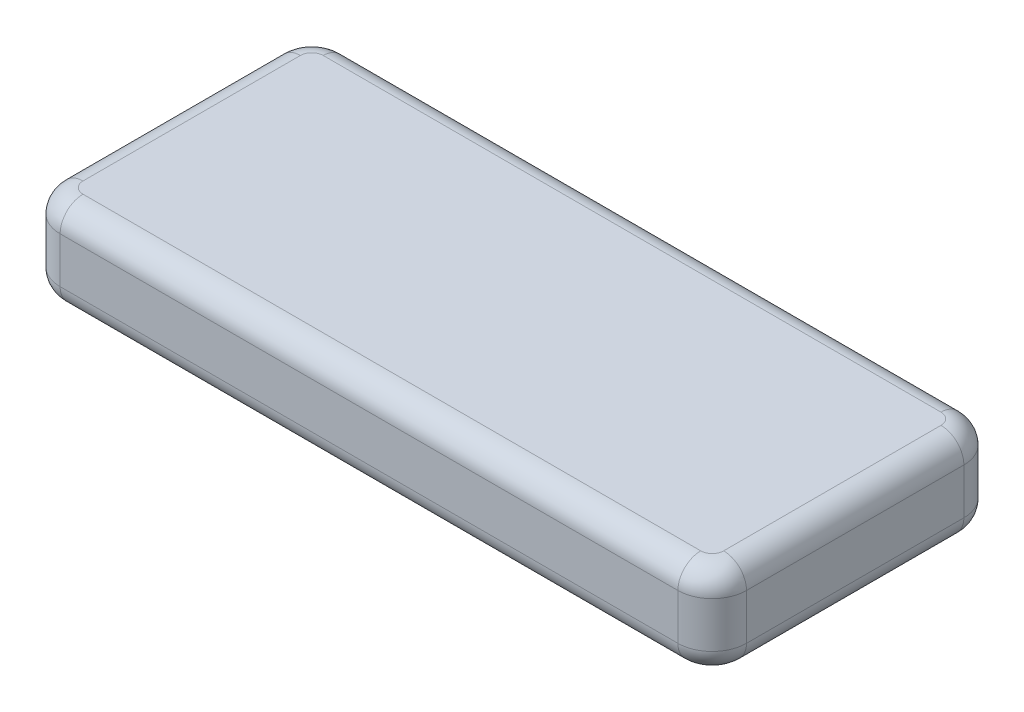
ISO-10303-21;
HEADER;
FILE_DESCRIPTION(('STEP AP214'),'2;1');
FILE_NAME('part.step','',(''),(''),'','','');
FILE_SCHEMA(('AUTOMOTIVE_DESIGN { 1 0 10303 214 1 1 1 1 }'));
ENDSEC;
DATA;
#1=APPLICATION_CONTEXT('core data for automotive mechanical design processes');
#2=APPLICATION_PROTOCOL_DEFINITION('international standard','automotive_design',2000,#1);
#3=PRODUCT_CONTEXT('',#1,'mechanical');
#4=PRODUCT('Part','Part','',(#3));
#5=PRODUCT_RELATED_PRODUCT_CATEGORY('part','',(#4));
#6=PRODUCT_DEFINITION_FORMATION('','',#4);
#7=PRODUCT_DEFINITION_CONTEXT('part definition',#1,'design');
#8=PRODUCT_DEFINITION('design','',#6,#7);
#9=PRODUCT_DEFINITION_SHAPE('','',#8);
#10=(LENGTH_UNIT() NAMED_UNIT(*) SI_UNIT(.MILLI.,.METRE.));
#11=(NAMED_UNIT(*) PLANE_ANGLE_UNIT() SI_UNIT($,.RADIAN.));
#12=(NAMED_UNIT(*) SI_UNIT($,.STERADIAN.) SOLID_ANGLE_UNIT());
#13=UNCERTAINTY_MEASURE_WITH_UNIT(LENGTH_MEASURE(1.E-05),#10,'distance_accuracy_value','');
#14=(GEOMETRIC_REPRESENTATION_CONTEXT(3) GLOBAL_UNCERTAINTY_ASSIGNED_CONTEXT((#13)) GLOBAL_UNIT_ASSIGNED_CONTEXT((#10,
#11,#12)) REPRESENTATION_CONTEXT('',''));
#15=CARTESIAN_POINT('',(0.,0.,0.));
#16=DIRECTION('',(0.,0.,1.));
#17=DIRECTION('',(1.,0.,0.));
#18=AXIS2_PLACEMENT_3D('',#15,#16,#17);
#19=CARTESIAN_POINT('',(27.,4.,9.5));
#20=DIRECTION('',(0.,-1.,0.));
#21=DIRECTION('',(0.,0.,-1.));
#22=AXIS2_PLACEMENT_3D('',#19,#20,#21);
#23=CYLINDRICAL_SURFACE('',#22,3.);
#24=DIRECTION('',(0.,-1.,0.));
#25=VECTOR('',#24,1.);
#26=CARTESIAN_POINT('',(30.,4.,9.49999999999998));
#27=LINE('',#26,#25);
#28=CARTESIAN_POINT('',(30.,2.,9.49999999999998));
#29=VERTEX_POINT('',#28);
#30=CARTESIAN_POINT('',(30.,-2.,9.49999999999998));
#31=VERTEX_POINT('',#30);
#32=EDGE_CURVE('E185',#29,#31,#27,.T.);
#33=ORIENTED_EDGE('',*,*,#32,.F.);
#34=CARTESIAN_POINT('',(27.,2.,9.5));
#35=DIRECTION('',(0.,1.,0.));
#36=DIRECTION('',(0.,0.,1.));
#37=AXIS2_PLACEMENT_3D('',#34,#35,#36);
#38=CIRCLE('',#37,3.);
#39=CARTESIAN_POINT('',(27.,2.,12.5));
#40=VERTEX_POINT('',#39);
#41=EDGE_CURVE('E237',#29,#40,#38,.F.);
#42=ORIENTED_EDGE('',*,*,#41,.T.);
#43=DIRECTION('',(0.,-1.,0.));
#44=VECTOR('',#43,1.);
#45=CARTESIAN_POINT('',(27.,4.,12.5));
#46=LINE('',#45,#44);
#47=CARTESIAN_POINT('',(27.,-2.,12.5));
#48=VERTEX_POINT('',#47);
#49=EDGE_CURVE('E288',#40,#48,#46,.T.);
#50=ORIENTED_EDGE('',*,*,#49,.T.);
#51=CARTESIAN_POINT('',(27.,-2.,9.5));
#52=DIRECTION('',(0.,1.,0.));
#53=DIRECTION('',(0.,0.,1.));
#54=AXIS2_PLACEMENT_3D('',#51,#52,#53);
#55=CIRCLE('',#54,3.);
#56=EDGE_CURVE('E234',#48,#31,#55,.T.);
#57=ORIENTED_EDGE('',*,*,#56,.T.);
#58=EDGE_LOOP('',(#33,#42,#50,#57));
#59=FACE_BOUND('',#58,.T.);
#60=ADVANCED_FACE('F48',(#59),#23,.T.);
#61=CARTESIAN_POINT('',(30.,4.,9.49999999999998));
#62=DIRECTION('',(-1.,0.,0.));
#63=DIRECTION('',(0.,0.,1.));
#64=AXIS2_PLACEMENT_3D('',#61,#62,#63);
#65=PLANE('',#64);
#66=DIRECTION('',(0.,-1.,0.));
#67=VECTOR('',#66,1.);
#68=CARTESIAN_POINT('',(30.,4.,-9.49999999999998));
#69=LINE('',#68,#67);
#70=CARTESIAN_POINT('',(30.,2.,-9.49999999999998));
#71=VERTEX_POINT('',#70);
#72=CARTESIAN_POINT('',(30.,-2.,-9.49999999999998));
#73=VERTEX_POINT('',#72);
#74=EDGE_CURVE('E353',#71,#73,#69,.T.);
#75=ORIENTED_EDGE('',*,*,#74,.F.);
#76=DIRECTION('',(0.,0.,-1.));
#77=VECTOR('',#76,1.);
#78=CARTESIAN_POINT('',(30.,2.,9.49999999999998));
#79=LINE('',#78,#77);
#80=EDGE_CURVE('E231',#71,#29,#79,.F.);
#81=ORIENTED_EDGE('',*,*,#80,.T.);
#82=ORIENTED_EDGE('',*,*,#32,.T.);
#83=DIRECTION('',(0.,0.,-1.));
#84=VECTOR('',#83,1.);
#85=CARTESIAN_POINT('',(30.,-2.,9.49999999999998));
#86=LINE('',#85,#84);
#87=EDGE_CURVE('E227',#31,#73,#86,.T.);
#88=ORIENTED_EDGE('',*,*,#87,.T.);
#89=EDGE_LOOP('',(#75,#81,#82,#88));
#90=FACE_BOUND('',#89,.T.);
#91=ADVANCED_FACE('F349',(#90),#65,.F.);
#92=CARTESIAN_POINT('',(27.,4.,-9.5));
#93=DIRECTION('',(0.,-1.,0.));
#94=DIRECTION('',(0.,0.,-1.));
#95=AXIS2_PLACEMENT_3D('',#92,#93,#94);
#96=CYLINDRICAL_SURFACE('',#95,3.);
#97=DIRECTION('',(0.,-1.,0.));
#98=VECTOR('',#97,1.);
#99=CARTESIAN_POINT('',(27.,4.,-12.5));
#100=LINE('',#99,#98);
#101=CARTESIAN_POINT('',(27.,2.,-12.5));
#102=VERTEX_POINT('',#101);
#103=CARTESIAN_POINT('',(27.,-2.,-12.5));
#104=VERTEX_POINT('',#103);
#105=EDGE_CURVE('E356',#102,#104,#100,.T.);
#106=ORIENTED_EDGE('',*,*,#105,.F.);
#107=CARTESIAN_POINT('',(27.,2.,-9.5));
#108=DIRECTION('',(0.,1.,0.));
#109=DIRECTION('',(0.,0.,1.));
#110=AXIS2_PLACEMENT_3D('',#107,#108,#109);
#111=CIRCLE('',#110,3.);
#112=EDGE_CURVE('E224',#102,#71,#111,.F.);
#113=ORIENTED_EDGE('',*,*,#112,.T.);
#114=ORIENTED_EDGE('',*,*,#74,.T.);
#115=CARTESIAN_POINT('',(27.,-2.,-9.5));
#116=DIRECTION('',(0.,1.,0.));
#117=DIRECTION('',(0.,0.,1.));
#118=AXIS2_PLACEMENT_3D('',#115,#116,#117);
#119=CIRCLE('',#118,3.);
#120=EDGE_CURVE('E221',#73,#104,#119,.T.);
#121=ORIENTED_EDGE('',*,*,#120,.T.);
#122=EDGE_LOOP('',(#106,#113,#114,#121));
#123=FACE_BOUND('',#122,.T.);
#124=ADVANCED_FACE('F435',(#123),#96,.T.);
#125=CARTESIAN_POINT('',(-27.,4.,-12.5));
#126=DIRECTION('',(0.,0.,1.));
#127=DIRECTION('',(1.,0.,0.));
#128=AXIS2_PLACEMENT_3D('',#125,#126,#127);
#129=PLANE('',#128);
#130=DIRECTION('',(0.,-1.,0.));
#131=VECTOR('',#130,1.);
#132=CARTESIAN_POINT('',(-27.,4.,-12.5));
#133=LINE('',#132,#131);
#134=CARTESIAN_POINT('',(-27.,2.,-12.5));
#135=VERTEX_POINT('',#134);
#136=CARTESIAN_POINT('',(-27.,-2.,-12.5));
#137=VERTEX_POINT('',#136);
#138=EDGE_CURVE('E398',#135,#137,#133,.T.);
#139=ORIENTED_EDGE('',*,*,#138,.F.);
#140=DIRECTION('',(-1.,0.,0.));
#141=VECTOR('',#140,1.);
#142=CARTESIAN_POINT('',(27.,2.,-12.5));
#143=LINE('',#142,#141);
#144=EDGE_CURVE('E218',#135,#102,#143,.F.);
#145=ORIENTED_EDGE('',*,*,#144,.T.);
#146=ORIENTED_EDGE('',*,*,#105,.T.);
#147=DIRECTION('',(-1.,0.,0.));
#148=VECTOR('',#147,1.);
#149=CARTESIAN_POINT('',(-27.,-2.,-12.5));
#150=LINE('',#149,#148);
#151=EDGE_CURVE('E215',#104,#137,#150,.T.);
#152=ORIENTED_EDGE('',*,*,#151,.T.);
#153=EDGE_LOOP('',(#139,#145,#146,#152));
#154=FACE_BOUND('',#153,.T.);
#155=ADVANCED_FACE('F411',(#154),#129,.F.);
#156=CARTESIAN_POINT('',(-27.,4.,-9.5));
#157=DIRECTION('',(0.,-1.,0.));
#158=DIRECTION('',(0.,0.,-1.));
#159=AXIS2_PLACEMENT_3D('',#156,#157,#158);
#160=CYLINDRICAL_SURFACE('',#159,3.);
#161=DIRECTION('',(0.,-1.,0.));
#162=VECTOR('',#161,1.);
#163=CARTESIAN_POINT('',(-30.,4.,-9.49999999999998));
#164=LINE('',#163,#162);
#165=CARTESIAN_POINT('',(-30.,2.,-9.49999999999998));
#166=VERTEX_POINT('',#165);
#167=CARTESIAN_POINT('',(-30.,-2.,-9.49999999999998));
#168=VERTEX_POINT('',#167);
#169=EDGE_CURVE('E394',#166,#168,#164,.T.);
#170=ORIENTED_EDGE('',*,*,#169,.F.);
#171=CARTESIAN_POINT('',(-27.,2.,-9.5));
#172=DIRECTION('',(0.,1.,0.));
#173=DIRECTION('',(0.,0.,1.));
#174=AXIS2_PLACEMENT_3D('',#171,#172,#173);
#175=CIRCLE('',#174,3.);
#176=EDGE_CURVE('E212',#166,#135,#175,.F.);
#177=ORIENTED_EDGE('',*,*,#176,.T.);
#178=ORIENTED_EDGE('',*,*,#138,.T.);
#179=CARTESIAN_POINT('',(-27.,-2.,-9.5));
#180=DIRECTION('',(0.,1.,0.));
#181=DIRECTION('',(0.,0.,1.));
#182=AXIS2_PLACEMENT_3D('',#179,#180,#181);
#183=CIRCLE('',#182,3.);
#184=EDGE_CURVE('E209',#137,#168,#183,.T.);
#185=ORIENTED_EDGE('',*,*,#184,.T.);
#186=EDGE_LOOP('',(#170,#177,#178,#185));
#187=FACE_BOUND('',#186,.T.);
#188=ADVANCED_FACE('F484',(#187),#160,.T.);
#189=CARTESIAN_POINT('',(-30.,4.,9.49999999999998));
#190=DIRECTION('',(1.,0.,0.));
#191=DIRECTION('',(0.,0.,-1.));
#192=AXIS2_PLACEMENT_3D('',#189,#190,#191);
#193=PLANE('',#192);
#194=DIRECTION('',(0.,-1.,0.));
#195=VECTOR('',#194,1.);
#196=CARTESIAN_POINT('',(-30.,4.,9.49999999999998));
#197=LINE('',#196,#195);
#198=CARTESIAN_POINT('',(-30.,2.,9.49999999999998));
#199=VERTEX_POINT('',#198);
#200=CARTESIAN_POINT('',(-30.,-2.,9.49999999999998));
#201=VERTEX_POINT('',#200);
#202=EDGE_CURVE('E389',#199,#201,#197,.T.);
#203=ORIENTED_EDGE('',*,*,#202,.F.);
#204=DIRECTION('',(0.,0.,1.));
#205=VECTOR('',#204,1.);
#206=CARTESIAN_POINT('',(-30.,2.,-9.49999999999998));
#207=LINE('',#206,#205);
#208=EDGE_CURVE('E206',#199,#166,#207,.F.);
#209=ORIENTED_EDGE('',*,*,#208,.T.);
#210=ORIENTED_EDGE('',*,*,#169,.T.);
#211=DIRECTION('',(0.,0.,1.));
#212=VECTOR('',#211,1.);
#213=CARTESIAN_POINT('',(-30.,-2.,9.49999999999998));
#214=LINE('',#213,#212);
#215=EDGE_CURVE('E203',#168,#201,#214,.T.);
#216=ORIENTED_EDGE('',*,*,#215,.T.);
#217=EDGE_LOOP('',(#203,#209,#210,#216));
#218=FACE_BOUND('',#217,.T.);
#219=ADVANCED_FACE('F392',(#218),#193,.F.);
#220=CARTESIAN_POINT('',(-27.,4.,9.5));
#221=DIRECTION('',(0.,-1.,0.));
#222=DIRECTION('',(0.,0.,-1.));
#223=AXIS2_PLACEMENT_3D('',#220,#221,#222);
#224=CYLINDRICAL_SURFACE('',#223,3.);
#225=DIRECTION('',(0.,-1.,0.));
#226=VECTOR('',#225,1.);
#227=CARTESIAN_POINT('',(-27.,4.,12.5));
#228=LINE('',#227,#226);
#229=CARTESIAN_POINT('',(-27.,2.,12.5));
#230=VERTEX_POINT('',#229);
#231=CARTESIAN_POINT('',(-27.,-2.,12.5));
#232=VERTEX_POINT('',#231);
#233=EDGE_CURVE('E391',#230,#232,#228,.T.);
#234=ORIENTED_EDGE('',*,*,#233,.F.);
#235=CARTESIAN_POINT('',(-27.,2.,9.5));
#236=DIRECTION('',(0.,1.,0.));
#237=DIRECTION('',(0.,0.,1.));
#238=AXIS2_PLACEMENT_3D('',#235,#236,#237);
#239=CIRCLE('',#238,3.);
#240=EDGE_CURVE('E170',#230,#199,#239,.F.);
#241=ORIENTED_EDGE('',*,*,#240,.T.);
#242=ORIENTED_EDGE('',*,*,#202,.T.);
#243=CARTESIAN_POINT('',(-27.,-2.,9.5));
#244=DIRECTION('',(0.,1.,0.));
#245=DIRECTION('',(0.,0.,1.));
#246=AXIS2_PLACEMENT_3D('',#243,#244,#245);
#247=CIRCLE('',#246,3.);
#248=EDGE_CURVE('E192',#201,#232,#247,.T.);
#249=ORIENTED_EDGE('',*,*,#248,.T.);
#250=EDGE_LOOP('',(#234,#241,#242,#249));
#251=FACE_BOUND('',#250,.T.);
#252=ADVANCED_FACE('F388',(#251),#224,.T.);
#253=CARTESIAN_POINT('',(-27.,4.,12.5));
#254=DIRECTION('',(0.,0.,-1.));
#255=DIRECTION('',(-1.,0.,0.));
#256=AXIS2_PLACEMENT_3D('',#253,#254,#255);
#257=PLANE('',#256);
#258=ORIENTED_EDGE('',*,*,#233,.T.);
#259=DIRECTION('',(1.,0.,0.));
#260=VECTOR('',#259,1.);
#261=CARTESIAN_POINT('',(-27.,-2.,12.5));
#262=LINE('',#261,#260);
#263=EDGE_CURVE('E11',#232,#48,#262,.T.);
#264=ORIENTED_EDGE('',*,*,#263,.T.);
#265=ORIENTED_EDGE('',*,*,#49,.F.);
#266=DIRECTION('',(1.,0.,0.));
#267=VECTOR('',#266,1.);
#268=CARTESIAN_POINT('',(-27.,2.,12.5));
#269=LINE('',#268,#267);
#270=EDGE_CURVE('E58',#40,#230,#269,.F.);
#271=ORIENTED_EDGE('',*,*,#270,.T.);
#272=EDGE_LOOP('',(#258,#264,#265,#271));
#273=FACE_BOUND('',#272,.T.);
#274=ADVANCED_FACE('F471',(#273),#257,.F.);
#275=CARTESIAN_POINT('',(27.,4.,9.5));
#276=DIRECTION('',(0.,1.,0.));
#277=DIRECTION('',(0.,0.,1.));
#278=AXIS2_PLACEMENT_3D('',#275,#276,#277);
#279=PLANE('',#278);
#280=DIRECTION('',(0.,0.,1.));
#281=VECTOR('',#280,1.);
#282=CARTESIAN_POINT('',(-28.,4.,9.49999999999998));
#283=LINE('',#282,#281);
#284=CARTESIAN_POINT('',(-28.,4.,-9.49999999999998));
#285=VERTEX_POINT('',#284);
#286=CARTESIAN_POINT('',(-28.,4.,9.49999999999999));
#287=VERTEX_POINT('',#286);
#288=EDGE_CURVE('E189',#285,#287,#283,.T.);
#289=ORIENTED_EDGE('',*,*,#288,.T.);
#290=CARTESIAN_POINT('',(-27.,4.,9.5));
#291=DIRECTION('',(0.,1.,0.));
#292=DIRECTION('',(0.,0.,1.));
#293=AXIS2_PLACEMENT_3D('',#290,#291,#292);
#294=CIRCLE('',#293,0.999999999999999);
#295=CARTESIAN_POINT('',(-27.,4.,10.5));
#296=VERTEX_POINT('',#295);
#297=EDGE_CURVE('E168',#287,#296,#294,.T.);
#298=ORIENTED_EDGE('',*,*,#297,.T.);
#299=DIRECTION('',(1.,0.,0.));
#300=VECTOR('',#299,1.);
#301=CARTESIAN_POINT('',(27.,4.,10.5));
#302=LINE('',#301,#300);
#303=CARTESIAN_POINT('',(27.,4.,10.5));
#304=VERTEX_POINT('',#303);
#305=EDGE_CURVE('E177',#296,#304,#302,.T.);
#306=ORIENTED_EDGE('',*,*,#305,.T.);
#307=CARTESIAN_POINT('',(27.,4.,9.5));
#308=DIRECTION('',(0.,1.,0.));
#309=DIRECTION('',(0.,0.,1.));
#310=AXIS2_PLACEMENT_3D('',#307,#308,#309);
#311=CIRCLE('',#310,0.999999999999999);
#312=CARTESIAN_POINT('',(28.,4.,9.49999999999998));
#313=VERTEX_POINT('',#312);
#314=EDGE_CURVE('E184',#304,#313,#311,.T.);
#315=ORIENTED_EDGE('',*,*,#314,.T.);
#316=DIRECTION('',(0.,0.,-1.));
#317=VECTOR('',#316,1.);
#318=CARTESIAN_POINT('',(28.,4.,-9.49999999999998));
#319=LINE('',#318,#317);
#320=CARTESIAN_POINT('',(28.,4.,-9.49999999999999));
#321=VERTEX_POINT('',#320);
#322=EDGE_CURVE('E362',#313,#321,#319,.T.);
#323=ORIENTED_EDGE('',*,*,#322,.T.);
#324=CARTESIAN_POINT('',(27.,4.,-9.5));
#325=DIRECTION('',(0.,1.,0.));
#326=DIRECTION('',(0.,0.,1.));
#327=AXIS2_PLACEMENT_3D('',#324,#325,#326);
#328=CIRCLE('',#327,0.999999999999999);
#329=CARTESIAN_POINT('',(27.,4.,-10.5));
#330=VERTEX_POINT('',#329);
#331=EDGE_CURVE('E365',#321,#330,#328,.T.);
#332=ORIENTED_EDGE('',*,*,#331,.T.);
#333=DIRECTION('',(-1.,0.,0.));
#334=VECTOR('',#333,1.);
#335=CARTESIAN_POINT('',(-27.,4.,-10.5));
#336=LINE('',#335,#334);
#337=CARTESIAN_POINT('',(-27.,4.,-10.5));
#338=VERTEX_POINT('',#337);
#339=EDGE_CURVE('E368',#330,#338,#336,.T.);
#340=ORIENTED_EDGE('',*,*,#339,.T.);
#341=CARTESIAN_POINT('',(-27.,4.,-9.5));
#342=DIRECTION('',(0.,1.,0.));
#343=DIRECTION('',(0.,0.,1.));
#344=AXIS2_PLACEMENT_3D('',#341,#342,#343);
#345=CIRCLE('',#344,0.999999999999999);
#346=EDGE_CURVE('E197',#338,#285,#345,.T.);
#347=ORIENTED_EDGE('',*,*,#346,.T.);
#348=EDGE_LOOP('',(#289,#298,#306,#315,#323,#332,#340,#347));
#349=FACE_BOUND('',#348,.T.);
#350=ADVANCED_FACE('F187',(#349),#279,.T.);
#351=CARTESIAN_POINT('',(27.,-4.,9.5));
#352=DIRECTION('',(0.,1.,0.));
#353=DIRECTION('',(0.,0.,1.));
#354=AXIS2_PLACEMENT_3D('',#351,#352,#353);
#355=PLANE('',#354);
#356=CARTESIAN_POINT('',(27.,-4.,-9.5));
#357=DIRECTION('',(0.,1.,0.));
#358=DIRECTION('',(0.,0.,1.));
#359=AXIS2_PLACEMENT_3D('',#356,#357,#358);
#360=CIRCLE('',#359,0.999999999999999);
#361=CARTESIAN_POINT('',(27.,-4.,-10.5));
#362=VERTEX_POINT('',#361);
#363=CARTESIAN_POINT('',(28.,-4.,-9.49999999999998));
#364=VERTEX_POINT('',#363);
#365=EDGE_CURVE('E66',#362,#364,#360,.F.);
#366=ORIENTED_EDGE('',*,*,#365,.T.);
#367=DIRECTION('',(0.,0.,-1.));
#368=VECTOR('',#367,1.);
#369=CARTESIAN_POINT('',(28.,-4.,9.5));
#370=LINE('',#369,#368);
#371=CARTESIAN_POINT('',(28.,-4.,9.49999999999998));
#372=VERTEX_POINT('',#371);
#373=EDGE_CURVE('E259',#364,#372,#370,.F.);
#374=ORIENTED_EDGE('',*,*,#373,.T.);
#375=CARTESIAN_POINT('',(27.,-4.,9.5));
#376=DIRECTION('',(0.,1.,0.));
#377=DIRECTION('',(0.,0.,1.));
#378=AXIS2_PLACEMENT_3D('',#375,#376,#377);
#379=CIRCLE('',#378,0.999999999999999);
#380=CARTESIAN_POINT('',(27.,-4.,10.5));
#381=VERTEX_POINT('',#380);
#382=EDGE_CURVE('E240',#372,#381,#379,.F.);
#383=ORIENTED_EDGE('',*,*,#382,.T.);
#384=DIRECTION('',(1.,0.,0.));
#385=VECTOR('',#384,1.);
#386=CARTESIAN_POINT('',(27.,-4.,10.5));
#387=LINE('',#386,#385);
#388=CARTESIAN_POINT('',(-27.,-4.,10.5));
#389=VERTEX_POINT('',#388);
#390=EDGE_CURVE('E243',#381,#389,#387,.F.);
#391=ORIENTED_EDGE('',*,*,#390,.T.);
#392=CARTESIAN_POINT('',(-27.,-4.,9.5));
#393=DIRECTION('',(0.,1.,0.));
#394=DIRECTION('',(0.,0.,1.));
#395=AXIS2_PLACEMENT_3D('',#392,#393,#394);
#396=CIRCLE('',#395,0.999999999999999);
#397=CARTESIAN_POINT('',(-28.,-4.,9.49999999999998));
#398=VERTEX_POINT('',#397);
#399=EDGE_CURVE('E246',#389,#398,#396,.F.);
#400=ORIENTED_EDGE('',*,*,#399,.T.);
#401=DIRECTION('',(0.,0.,1.));
#402=VECTOR('',#401,1.);
#403=CARTESIAN_POINT('',(-28.,-4.,9.5));
#404=LINE('',#403,#402);
#405=CARTESIAN_POINT('',(-28.,-4.,-9.49999999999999));
#406=VERTEX_POINT('',#405);
#407=EDGE_CURVE('E249',#398,#406,#404,.F.);
#408=ORIENTED_EDGE('',*,*,#407,.T.);
#409=CARTESIAN_POINT('',(-27.,-4.,-9.5));
#410=DIRECTION('',(0.,1.,0.));
#411=DIRECTION('',(0.,0.,1.));
#412=AXIS2_PLACEMENT_3D('',#409,#410,#411);
#413=CIRCLE('',#412,0.999999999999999);
#414=CARTESIAN_POINT('',(-27.,-4.,-10.5));
#415=VERTEX_POINT('',#414);
#416=EDGE_CURVE('E252',#406,#415,#413,.F.);
#417=ORIENTED_EDGE('',*,*,#416,.T.);
#418=DIRECTION('',(-1.,0.,0.));
#419=VECTOR('',#418,1.);
#420=CARTESIAN_POINT('',(27.,-4.,-10.5));
#421=LINE('',#420,#419);
#422=EDGE_CURVE('E71',#415,#362,#421,.F.);
#423=ORIENTED_EDGE('',*,*,#422,.T.);
#424=EDGE_LOOP('',(#366,#374,#383,#391,#400,#408,#417,#423));
#425=FACE_BOUND('',#424,.T.);
#426=ADVANCED_FACE('F328',(#425),#355,.F.);
#427=CARTESIAN_POINT('',(27.,2.,-9.5));
#428=DIRECTION('',(0.,1.,0.));
#429=DIRECTION('',(0.,0.,1.));
#430=AXIS2_PLACEMENT_3D('',#427,#428,#429);
#431=DEGENERATE_TOROIDAL_SURFACE('',#430,0.999999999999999,2.,.T.);
#432=CARTESIAN_POINT('',(28.,2.,-9.49999999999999));
#433=DIRECTION('',(0.,0.,1.));
#434=DIRECTION('',(1.,0.,0.));
#435=AXIS2_PLACEMENT_3D('',#432,#433,#434);
#436=CIRCLE('',#435,2.);
#437=EDGE_CURVE('E280',#71,#321,#436,.T.);
#438=ORIENTED_EDGE('',*,*,#437,.F.);
#439=ORIENTED_EDGE('',*,*,#112,.F.);
#440=CARTESIAN_POINT('',(27.,2.,-10.5));
#441=DIRECTION('',(-1.,0.,0.));
#442=DIRECTION('',(0.,0.,1.));
#443=AXIS2_PLACEMENT_3D('',#440,#441,#442);
#444=CIRCLE('',#443,2.);
#445=EDGE_CURVE('E284',#330,#102,#444,.T.);
#446=ORIENTED_EDGE('',*,*,#445,.F.);
#447=ORIENTED_EDGE('',*,*,#331,.F.);
#448=EDGE_LOOP('',(#438,#439,#446,#447));
#449=FACE_BOUND('',#448,.T.);
#450=ADVANCED_FACE('F457',(#449),#431,.T.);
#451=CARTESIAN_POINT('',(27.,2.,-10.5));
#452=DIRECTION('',(1.,0.,0.));
#453=DIRECTION('',(0.,0.,-1.));
#454=AXIS2_PLACEMENT_3D('',#451,#452,#453);
#455=CYLINDRICAL_SURFACE('',#454,2.);
#456=ORIENTED_EDGE('',*,*,#445,.T.);
#457=ORIENTED_EDGE('',*,*,#144,.F.);
#458=CARTESIAN_POINT('',(-27.,2.,-10.5));
#459=DIRECTION('',(-1.,0.,0.));
#460=DIRECTION('',(0.,0.,1.));
#461=AXIS2_PLACEMENT_3D('',#458,#459,#460);
#462=CIRCLE('',#461,2.);
#463=EDGE_CURVE('E276',#338,#135,#462,.T.);
#464=ORIENTED_EDGE('',*,*,#463,.F.);
#465=ORIENTED_EDGE('',*,*,#339,.F.);
#466=EDGE_LOOP('',(#456,#457,#464,#465));
#467=FACE_BOUND('',#466,.T.);
#468=ADVANCED_FACE('F454',(#467),#455,.T.);
#469=CARTESIAN_POINT('',(28.,2.,9.5));
#470=DIRECTION('',(0.,0.,1.));
#471=DIRECTION('',(1.,0.,0.));
#472=AXIS2_PLACEMENT_3D('',#469,#470,#471);
#473=CYLINDRICAL_SURFACE('',#472,2.);
#474=ORIENTED_EDGE('',*,*,#437,.T.);
#475=ORIENTED_EDGE('',*,*,#322,.F.);
#476=CARTESIAN_POINT('',(28.,2.,9.49999999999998));
#477=DIRECTION('',(0.,0.,1.));
#478=DIRECTION('',(1.,0.,0.));
#479=AXIS2_PLACEMENT_3D('',#476,#477,#478);
#480=CIRCLE('',#479,2.);
#481=EDGE_CURVE('E272',#29,#313,#480,.T.);
#482=ORIENTED_EDGE('',*,*,#481,.F.);
#483=ORIENTED_EDGE('',*,*,#80,.F.);
#484=EDGE_LOOP('',(#474,#475,#482,#483));
#485=FACE_BOUND('',#484,.T.);
#486=ADVANCED_FACE('F451',(#485),#473,.T.);
#487=CARTESIAN_POINT('',(-27.,2.,-9.5));
#488=DIRECTION('',(0.,1.,0.));
#489=DIRECTION('',(0.,0.,1.));
#490=AXIS2_PLACEMENT_3D('',#487,#488,#489);
#491=DEGENERATE_TOROIDAL_SURFACE('',#490,0.999999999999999,2.,.T.);
#492=ORIENTED_EDGE('',*,*,#463,.T.);
#493=ORIENTED_EDGE('',*,*,#176,.F.);
#494=CARTESIAN_POINT('',(-28.,2.,-9.49999999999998));
#495=DIRECTION('',(0.,0.,1.));
#496=DIRECTION('',(1.,0.,0.));
#497=AXIS2_PLACEMENT_3D('',#494,#495,#496);
#498=CIRCLE('',#497,2.);
#499=EDGE_CURVE('E268',#285,#166,#498,.T.);
#500=ORIENTED_EDGE('',*,*,#499,.F.);
#501=ORIENTED_EDGE('',*,*,#346,.F.);
#502=EDGE_LOOP('',(#492,#493,#500,#501));
#503=FACE_BOUND('',#502,.T.);
#504=ADVANCED_FACE('F377',(#503),#491,.T.);
#505=CARTESIAN_POINT('',(27.,2.,9.5));
#506=DIRECTION('',(0.,1.,0.));
#507=DIRECTION('',(0.,0.,1.));
#508=AXIS2_PLACEMENT_3D('',#505,#506,#507);
#509=DEGENERATE_TOROIDAL_SURFACE('',#508,0.999999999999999,2.,.T.);
#510=ORIENTED_EDGE('',*,*,#481,.T.);
#511=ORIENTED_EDGE('',*,*,#314,.F.);
#512=CARTESIAN_POINT('',(27.,2.,10.5));
#513=DIRECTION('',(-1.,0.,0.));
#514=DIRECTION('',(0.,0.,1.));
#515=AXIS2_PLACEMENT_3D('',#512,#513,#514);
#516=CIRCLE('',#515,2.);
#517=EDGE_CURVE('E180',#40,#304,#516,.T.);
#518=ORIENTED_EDGE('',*,*,#517,.F.);
#519=ORIENTED_EDGE('',*,*,#41,.F.);
#520=EDGE_LOOP('',(#510,#511,#518,#519));
#521=FACE_BOUND('',#520,.T.);
#522=ADVANCED_FACE('F445',(#521),#509,.T.);
#523=CARTESIAN_POINT('',(-28.,2.,9.5));
#524=DIRECTION('',(0.,0.,-1.));
#525=DIRECTION('',(-1.,0.,0.));
#526=AXIS2_PLACEMENT_3D('',#523,#524,#525);
#527=CYLINDRICAL_SURFACE('',#526,2.);
#528=ORIENTED_EDGE('',*,*,#499,.T.);
#529=ORIENTED_EDGE('',*,*,#208,.F.);
#530=CARTESIAN_POINT('',(-28.,2.,9.49999999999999));
#531=DIRECTION('',(0.,0.,1.));
#532=DIRECTION('',(1.,0.,0.));
#533=AXIS2_PLACEMENT_3D('',#530,#531,#532);
#534=CIRCLE('',#533,2.);
#535=EDGE_CURVE('E174',#287,#199,#534,.T.);
#536=ORIENTED_EDGE('',*,*,#535,.F.);
#537=ORIENTED_EDGE('',*,*,#288,.F.);
#538=EDGE_LOOP('',(#528,#529,#536,#537));
#539=FACE_BOUND('',#538,.T.);
#540=ADVANCED_FACE('F380',(#539),#527,.T.);
#541=CARTESIAN_POINT('',(27.,2.,10.5));
#542=DIRECTION('',(-1.,0.,0.));
#543=DIRECTION('',(0.,0.,1.));
#544=AXIS2_PLACEMENT_3D('',#541,#542,#543);
#545=CYLINDRICAL_SURFACE('',#544,2.);
#546=ORIENTED_EDGE('',*,*,#517,.T.);
#547=ORIENTED_EDGE('',*,*,#305,.F.);
#548=CARTESIAN_POINT('',(-27.,2.,10.5));
#549=DIRECTION('',(-1.,0.,0.));
#550=DIRECTION('',(0.,-1.,0.));
#551=AXIS2_PLACEMENT_3D('',#548,#549,#550);
#552=CIRCLE('',#551,2.);
#553=EDGE_CURVE('E164',#230,#296,#552,.T.);
#554=ORIENTED_EDGE('',*,*,#553,.F.);
#555=ORIENTED_EDGE('',*,*,#270,.F.);
#556=EDGE_LOOP('',(#546,#547,#554,#555));
#557=FACE_BOUND('',#556,.T.);
#558=ADVANCED_FACE('F178',(#557),#545,.T.);
#559=CARTESIAN_POINT('',(-27.,2.,9.5));
#560=DIRECTION('',(0.,1.,0.));
#561=DIRECTION('',(0.,0.,1.));
#562=AXIS2_PLACEMENT_3D('',#559,#560,#561);
#563=DEGENERATE_TOROIDAL_SURFACE('',#562,0.999999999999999,2.,.T.);
#564=ORIENTED_EDGE('',*,*,#535,.T.);
#565=ORIENTED_EDGE('',*,*,#240,.F.);
#566=ORIENTED_EDGE('',*,*,#553,.T.);
#567=ORIENTED_EDGE('',*,*,#297,.F.);
#568=EDGE_LOOP('',(#564,#565,#566,#567));
#569=FACE_BOUND('',#568,.T.);
#570=ADVANCED_FACE('F166',(#569),#563,.T.);
#571=CARTESIAN_POINT('',(-28.,-2.,9.49999999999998));
#572=DIRECTION('',(0.,0.,1.));
#573=DIRECTION('',(1.,0.,0.));
#574=AXIS2_PLACEMENT_3D('',#571,#572,#573);
#575=CYLINDRICAL_SURFACE('',#574,2.);
#576=CARTESIAN_POINT('',(-28.,-2.,-9.49999999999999));
#577=DIRECTION('',(0.,0.,-1.));
#578=DIRECTION('',(-1.,0.,0.));
#579=AXIS2_PLACEMENT_3D('',#576,#577,#578);
#580=CIRCLE('',#579,2.);
#581=EDGE_CURVE('E310',#406,#168,#580,.T.);
#582=ORIENTED_EDGE('',*,*,#581,.F.);
#583=ORIENTED_EDGE('',*,*,#407,.F.);
#584=CARTESIAN_POINT('',(-28.,-2.,9.49999999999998));
#585=DIRECTION('',(0.,0.,1.));
#586=DIRECTION('',(1.,0.,0.));
#587=AXIS2_PLACEMENT_3D('',#584,#585,#586);
#588=CIRCLE('',#587,2.);
#589=EDGE_CURVE('E52',#201,#398,#588,.T.);
#590=ORIENTED_EDGE('',*,*,#589,.F.);
#591=ORIENTED_EDGE('',*,*,#215,.F.);
#592=EDGE_LOOP('',(#582,#583,#590,#591));
#593=FACE_BOUND('',#592,.T.);
#594=ADVANCED_FACE('F50',(#593),#575,.T.);
#595=CARTESIAN_POINT('',(-27.,-2.,9.5));
#596=DIRECTION('',(0.,1.,0.));
#597=DIRECTION('',(0.,0.,1.));
#598=AXIS2_PLACEMENT_3D('',#595,#596,#597);
#599=DEGENERATE_TOROIDAL_SURFACE('',#598,0.999999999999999,2.,.T.);
#600=ORIENTED_EDGE('',*,*,#589,.T.);
#601=ORIENTED_EDGE('',*,*,#399,.F.);
#602=CARTESIAN_POINT('',(-27.,-2.,10.5));
#603=DIRECTION('',(1.,0.,0.));
#604=DIRECTION('',(0.,0.,-1.));
#605=AXIS2_PLACEMENT_3D('',#602,#603,#604);
#606=CIRCLE('',#605,2.);
#607=EDGE_CURVE('E307',#232,#389,#606,.T.);
#608=ORIENTED_EDGE('',*,*,#607,.F.);
#609=ORIENTED_EDGE('',*,*,#248,.F.);
#610=EDGE_LOOP('',(#600,#601,#608,#609));
#611=FACE_BOUND('',#610,.T.);
#612=ADVANCED_FACE('F323',(#611),#599,.T.);
#613=CARTESIAN_POINT('',(-27.,-2.,-9.5));
#614=DIRECTION('',(0.,1.,0.));
#615=DIRECTION('',(0.,0.,1.));
#616=AXIS2_PLACEMENT_3D('',#613,#614,#615);
#617=DEGENERATE_TOROIDAL_SURFACE('',#616,0.999999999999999,2.,.T.);
#618=ORIENTED_EDGE('',*,*,#581,.T.);
#619=ORIENTED_EDGE('',*,*,#184,.F.);
#620=CARTESIAN_POINT('',(-27.,-2.,-10.5));
#621=DIRECTION('',(1.,0.,0.));
#622=DIRECTION('',(0.,0.,-1.));
#623=AXIS2_PLACEMENT_3D('',#620,#621,#622);
#624=CIRCLE('',#623,2.);
#625=EDGE_CURVE('E303',#415,#137,#624,.T.);
#626=ORIENTED_EDGE('',*,*,#625,.F.);
#627=ORIENTED_EDGE('',*,*,#416,.F.);
#628=EDGE_LOOP('',(#618,#619,#626,#627));
#629=FACE_BOUND('',#628,.T.);
#630=ADVANCED_FACE('F578',(#629),#617,.T.);
#631=CARTESIAN_POINT('',(-27.,-2.,10.5));
#632=DIRECTION('',(1.,0.,0.));
#633=DIRECTION('',(0.,0.,-1.));
#634=AXIS2_PLACEMENT_3D('',#631,#632,#633);
#635=CYLINDRICAL_SURFACE('',#634,2.);
#636=ORIENTED_EDGE('',*,*,#607,.T.);
#637=ORIENTED_EDGE('',*,*,#390,.F.);
#638=CARTESIAN_POINT('',(27.,-2.,10.5));
#639=DIRECTION('',(1.,0.,0.));
#640=DIRECTION('',(0.,0.,-1.));
#641=AXIS2_PLACEMENT_3D('',#638,#639,#640);
#642=CIRCLE('',#641,2.);
#643=EDGE_CURVE('E299',#48,#381,#642,.T.);
#644=ORIENTED_EDGE('',*,*,#643,.F.);
#645=ORIENTED_EDGE('',*,*,#263,.F.);
#646=EDGE_LOOP('',(#636,#637,#644,#645));
#647=FACE_BOUND('',#646,.T.);
#648=ADVANCED_FACE('F334',(#647),#635,.T.);
#649=CARTESIAN_POINT('',(-27.,-2.,-10.5));
#650=DIRECTION('',(-1.,0.,0.));
#651=DIRECTION('',(0.,0.,1.));
#652=AXIS2_PLACEMENT_3D('',#649,#650,#651);
#653=CYLINDRICAL_SURFACE('',#652,2.);
#654=ORIENTED_EDGE('',*,*,#625,.T.);
#655=ORIENTED_EDGE('',*,*,#151,.F.);
#656=CARTESIAN_POINT('',(27.,-2.,-10.5));
#657=DIRECTION('',(1.,0.,0.));
#658=DIRECTION('',(0.,0.,-1.));
#659=AXIS2_PLACEMENT_3D('',#656,#657,#658);
#660=CIRCLE('',#659,2.);
#661=EDGE_CURVE('E295',#362,#104,#660,.T.);
#662=ORIENTED_EDGE('',*,*,#661,.F.);
#663=ORIENTED_EDGE('',*,*,#422,.F.);
#664=EDGE_LOOP('',(#654,#655,#662,#663));
#665=FACE_BOUND('',#664,.T.);
#666=ADVANCED_FACE('F416',(#665),#653,.T.);
#667=CARTESIAN_POINT('',(27.,-2.,9.5));
#668=DIRECTION('',(0.,1.,0.));
#669=DIRECTION('',(0.,0.,1.));
#670=AXIS2_PLACEMENT_3D('',#667,#668,#669);
#671=DEGENERATE_TOROIDAL_SURFACE('',#670,0.999999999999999,2.,.T.);
#672=ORIENTED_EDGE('',*,*,#643,.T.);
#673=ORIENTED_EDGE('',*,*,#382,.F.);
#674=CARTESIAN_POINT('',(28.,-2.,9.49999999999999));
#675=DIRECTION('',(0.,0.,-1.));
#676=DIRECTION('',(0.,1.,0.));
#677=AXIS2_PLACEMENT_3D('',#674,#675,#676);
#678=CIRCLE('',#677,2.);
#679=EDGE_CURVE('E292',#31,#372,#678,.T.);
#680=ORIENTED_EDGE('',*,*,#679,.F.);
#681=ORIENTED_EDGE('',*,*,#56,.F.);
#682=EDGE_LOOP('',(#672,#673,#680,#681));
#683=FACE_BOUND('',#682,.T.);
#684=ADVANCED_FACE('F338',(#683),#671,.T.);
#685=CARTESIAN_POINT('',(27.,-2.,-9.5));
#686=DIRECTION('',(0.,1.,0.));
#687=DIRECTION('',(0.,0.,1.));
#688=AXIS2_PLACEMENT_3D('',#685,#686,#687);
#689=DEGENERATE_TOROIDAL_SURFACE('',#688,0.999999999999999,2.,.T.);
#690=ORIENTED_EDGE('',*,*,#661,.T.);
#691=ORIENTED_EDGE('',*,*,#120,.F.);
#692=CARTESIAN_POINT('',(28.,-2.,-9.49999999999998));
#693=DIRECTION('',(0.,0.,1.));
#694=DIRECTION('',(1.,0.,0.));
#695=AXIS2_PLACEMENT_3D('',#692,#693,#694);
#696=CIRCLE('',#695,2.);
#697=EDGE_CURVE('E289',#364,#73,#696,.T.);
#698=ORIENTED_EDGE('',*,*,#697,.F.);
#699=ORIENTED_EDGE('',*,*,#365,.F.);
#700=EDGE_LOOP('',(#690,#691,#698,#699));
#701=FACE_BOUND('',#700,.T.);
#702=ADVANCED_FACE('F419',(#701),#689,.T.);
#703=CARTESIAN_POINT('',(28.,-2.,9.49999999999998));
#704=DIRECTION('',(0.,0.,-1.));
#705=DIRECTION('',(-1.,0.,0.));
#706=AXIS2_PLACEMENT_3D('',#703,#704,#705);
#707=CYLINDRICAL_SURFACE('',#706,2.);
#708=ORIENTED_EDGE('',*,*,#679,.T.);
#709=ORIENTED_EDGE('',*,*,#373,.F.);
#710=ORIENTED_EDGE('',*,*,#697,.T.);
#711=ORIENTED_EDGE('',*,*,#87,.F.);
#712=EDGE_LOOP('',(#708,#709,#710,#711));
#713=FACE_BOUND('',#712,.T.);
#714=ADVANCED_FACE('F422',(#713),#707,.T.);
#715=CLOSED_SHELL('',(#60,#91,#124,#155,#188,#219,#252,#274,#350,#426,#450,#468,#486,#504,#522,
#540,#558,#570,#594,#612,#630,#648,#666,#684,#702,#714));
#716=MANIFOLD_SOLID_BREP('B2',#715);
#717=ADVANCED_BREP_SHAPE_REPRESENTATION('',(#18,#716),#14);
#718=SHAPE_DEFINITION_REPRESENTATION(#9,#717);
ENDSEC;
END-ISO-10303-21;
